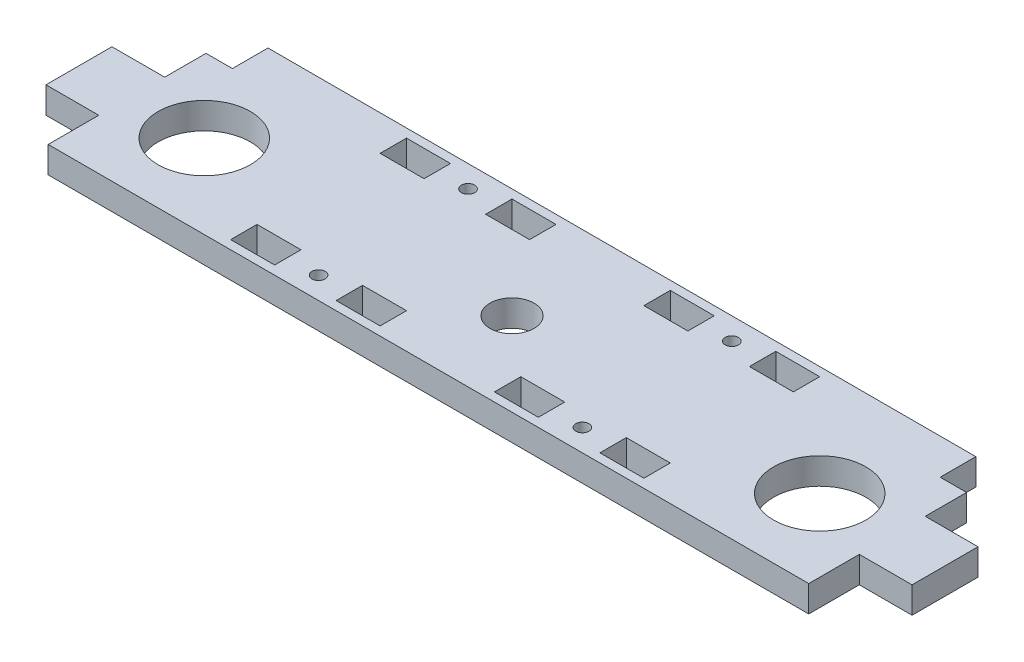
from build123d import *
from build123d.topology import SkipClean

# Parameters (mm, degrees)
SKETCH_1_R      = 10.5
SKETCH_1_R_2    = 1.5
SKETCH_1_W      = 10
SKETCH_1_H      = 6
EXTRUDE_1_DEPTH = 6


with BuildPart() as part:
    # Sketch 1 → Extrude 1 (new body)
    with BuildSketch(Plane(origin=(0, 0, 0), x_dir=(1, 0, 0), z_dir=(0, 1, 0))):
        with BuildLine():
            Line((0, -5), (0, -19))
            Line((0, -19), (86.5, -19))
            Line((86.5, -19), (86.5, -7.5))
            Line((86.5, -7.5), (98.5, -7.5))
            Line((98.5, -7.5), (98.5, 7.5))
            Line((98.5, 7.5), (86.5, 7.5))
            Line((86.5, 7.5), (86.5, 16.9))
            Line((86.5, 16.9), (80.5, 16.9))
            Line((80.5, 16.9), (80.5, 25))
            Line((80.5, 25), (0, 25))
            Line((0, 25), (0, 5))
            ThreePointArc((0, 5), (5, 0), (0, -5))
        make_face()
        with Locations(Location((70, 0, 0), (0, 0, 270))):
            Circle(SKETCH_1_R, mode=Mode.SUBTRACT)
        with Locations(Location((30, 20, 0), (0, 0, 270))):
            Circle(SKETCH_1_R_2, mode=Mode.SUBTRACT)
        with Locations(Location((30, -14, 0), (0, 0, 90))):
            Circle(SKETCH_1_R_2, mode=Mode.SUBTRACT)
        with Locations((18, 20)):
            Rectangle(SKETCH_1_W, SKETCH_1_H, mode=Mode.SUBTRACT)
        with Locations((42, 20)):
            Rectangle(SKETCH_1_W, SKETCH_1_H, mode=Mode.SUBTRACT)
        with Locations((42, -14)):
            Rectangle(SKETCH_1_W, SKETCH_1_H, mode=Mode.SUBTRACT)
        with Locations((18, -14)):
            Rectangle(SKETCH_1_W, SKETCH_1_H, mode=Mode.SUBTRACT)
    extrude(amount=EXTRUDE_1_DEPTH)

    # Mirror 1: part across plane


with BuildPart() as part_1:
    with SkipClean():  # the faces are left unmerged after this step: merging them gives an invalid solid
        add(part.part)
        add(part.part.mirror(Plane(origin=(0, 6, -25), x_dir=(0, 0, 1), z_dir=(1, 0, 0))))


solid = part_1.part
